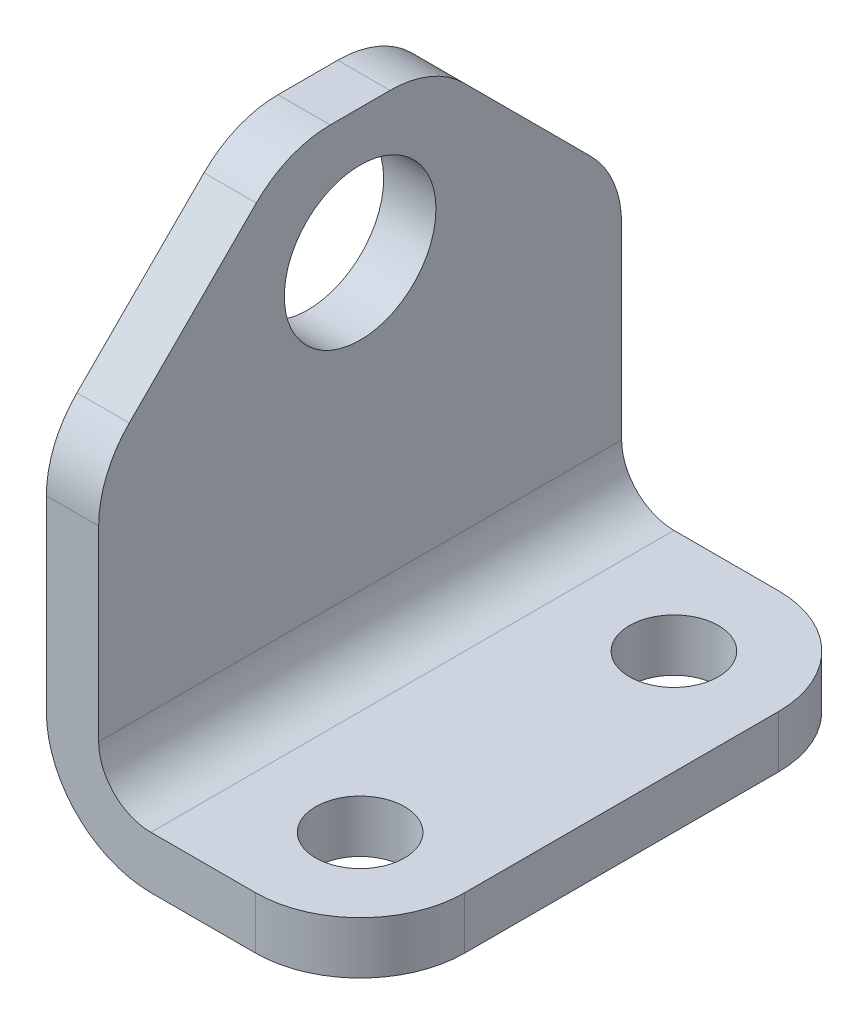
from build123d import *

# Parameters (mm, degrees)
BOSS_EXTRU_1_DEPTH      = 50
CONG_1_R                = 5
CONG_2_R                = 10
ESQUISSE2_R             = 4.25
ENL_V_MAT_EXTRU_1_DEPTH = 77.811457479
TROU_TARAUD_M16X1_51_D  = 14.5
CHANFREIN1_SIZE         = 18
CONG_3_R                = 10


with BuildPart() as part:
    # Esquisse1 → Boss.-Extru.1 (new body)
    with BuildSketch(Plane.XY):
        Polygon((0, 50), (5, 50), (5, 5), (30, 5), (30, 0), (0, 0), align=None)
    extrude(amount=BOSS_EXTRU_1_DEPTH)

    # Cong_1
    cong_1_edges = [part.edges().sort_by_distance(p)[0] for p in [
        (5, 5, 25),
    ]]
    fillet(cong_1_edges, radius=CONG_1_R)

    # Cong_2
    cong_2_edges = [part.edges().sort_by_distance(p)[0] for p in [
        (0, 0, 25),
    ]]
    fillet(cong_2_edges, radius=CONG_2_R)

    # Esquisse2 → Enl_v. mat.-Extru.1 (cut, through all)
    with BuildSketch(Plane.XZ):
        with Locations(Location((20, 40, 0), (0, 0, 270))):
            Circle(ESQUISSE2_R)
        with Locations(Location((20, 10, 0), (0, 0, 270))):
            Circle(ESQUISSE2_R)
    extrude(amount=-ENL_V_MAT_EXTRU_1_DEPTH, mode=Mode.SUBTRACT)

    # Trou taraud_ M16x1.51 (through all)
    with Locations(Plane(origin=(5, 0, 0), x_dir=(0, 0, -1), z_dir=(1, 0, 0))):
        with Locations((-25, 38)):
            Hole(TROU_TARAUD_M16X1_51_D / 2)

    # Chanfrein1
    chanfrein1_edges = [part.edges().sort_by_distance(p)[0] for p in [
        (2.5, 50, 50),
        (2.5, 50, 0),
    ]]
    chamfer(chanfrein1_edges, length=CHANFREIN1_SIZE)

    # Cong_3
    cong_3_edges = [part.edges().sort_by_distance(p)[0] for p in [
        (30, 2.5, 50),
        (2.5, 50, 32),
        (2.5, 50, 18),
        (2.5, 32, 0),
        (2.5, 32, 50),
        (30, 2.5, 0),
    ]]
    fillet(cong_3_edges, radius=CONG_3_R)


solid = part.part
